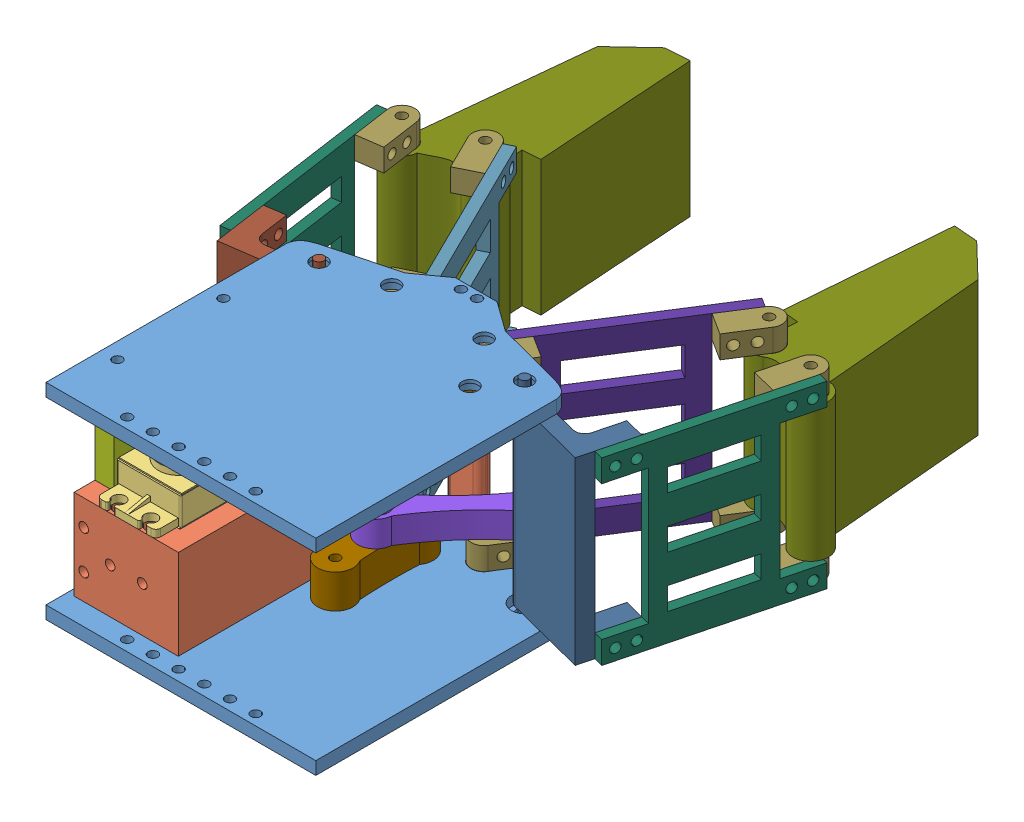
SolidWorks assembly claw assembly.SLDASM, configuration Default (file format 15000). Lengths in mm.
Overall size (189.96 66 208.3).
34 component instances, 20 part files, 67 mates.
Components (placement in the parent):
- new wall partition(inner)-1: new wall partition(inner).SLDPRT [Default] at (40 4 -80) x (-1 0 0) z (0 0 1) size (84 4 91.94)
- servo mount-1: servo mount.SLDPRT [Default] at (16.23 4 -30.49) size (32.46 28 54)
- Servo MG996R-1: Servo MG996R.SLDPRT [По умолчанию] at (16.23 11.5 -33.74) x (0 0 1) z (0 1 0) size (54.5 20.5 40.7)
- flange for servo-1: flange for servo.SLDPRT [Default] at (16.23 50.7 -43.94) x (-0.124022 0 -0.992279) z (-0.992279 0 0.124022) size (20 6 20)
- mechanism flange connector-1: mechanism flange connector.SLDPRT [Default] at (16.23 50.7 -43.94) x (0.992279 0 -0.124022) z (0.124022 0 0.992279) size (41 3 20)
- joint-1: joint.SLDPRT [Default] at (41.0244 45.7 -59.5406) x (0.999999 0 -0.001005) z (0.001005 0 0.999999) size (11 5 36)
- extended wall-1: extended wall.SLDPRT [Default] at (2.99 4 -33.74) size (5.98 56 41)
- long joint-1: long joint.SLDPRT [Default] at (29.4044 37.7 -71.6978) x (0.722901 0 -0.690951) z (0.690951 0 0.722901) size (11 8 51)
- long joint-2: long joint.SLDPRT [Default] at (52.4139 14.7 -71.9141) x (0.735758 0 0.677244) z (-0.677244 0 0.735758) size (11 8 51)
- joint (with hole)-1: joint (with hole).SLDPRT [Default] at (41.0244 4.2 -59.5406) x (0.999999 0 -0.001005) z (0.001005 0 0.999999) size (11 10.5 36)
- L connector( right side)-1: L connector( right side).SLDPRT [Default] at (93.5655 32 -69.443) x (-0.968367 0 -0.249528) z (-0.249528 0 0.968367) size (35.91 66 17.56)
- L connector-1: L connector.SLDPRT [Default] at (-14.0432 32 -71.8295) x (0.989814 0 -0.142368) z (0.142368 0 0.989814) size (35.91 66 17.56)
- nail connector with hole-1: nail connector with hole.SLDPRT [Default] at (25.6 53 -80) x (-0.896581 0 0.442879) z (-0.442879 0 -0.896581) size (8 7 15.99)
- nail connector with hole-2: nail connector with hole.SLDPRT [Default] at (25.6 4 -80) x (-0.896581 0 0.442879) z (-0.442879 0 -0.896581) size (8 7 15.99)
- square connector-1: square connector.SLDPRT [Default] at (41.0244 22.7 -59.5406) size (7 15 7)
- plank connector(inner left)(40.30mm)-1: plank connector(inner left)(40.30mm).SLDPRT [Default] at (14.9523 32 -110.5873) x (0.896581 0 -0.442879) z (0 -1 0) size (3.3 65.04 59.85)
- plank connector-1: plank connector.SLDPRT [Default] at (-25.317 32 -101.8149) x (0.989814 0 -0.142368) z (0 -1 0) size (3 64.46 59.85)
- new claw-1: new claw.SLDPRT [Default] at (10.7806 32 -47.0046) x (0.997719 0 -0.067502) z (0.067502 0 0.997719) size (104.57 42 197.84)
- nail connector with hole-3: nail connector with hole.SLDPRT [Default] at (-22.4849 53 -131.293) x (0.989814 0 -0.142368) z (0.142368 0 0.989814) size (8 7 15.99)
- nail connector with hole-4: nail connector with hole.SLDPRT [Default] at (-22.4849 4 -131.293) x (0.989814 0 -0.142368) z (0.142368 0 0.989814) size (8 7 15.99)
- nail connector with hole-5: nail connector with hole.SLDPRT [Default] at (-2.868 4 -137.6316) x (0.896581 0 -0.442879) z (0.442879 0 0.896581) size (8 7 15.99)
- nail connector with hole-6: nail connector with hole.SLDPRT [Default] at (-2.868 53 -137.6316) x (0.896581 0 -0.442879) z (0.442879 0 0.896581) size (8 7 15.99)
- nail connector with hole-7: nail connector with hole.SLDPRT [Default] at (54.4 3.9949 -80) x (-0.8436 0 -0.536973) z (0.536973 0 -0.8436) size (8 7 15.99)
- nail connector with hole-8: nail connector with hole.SLDPRT [Default] at (54.4 52.9949 -80) x (-0.8436 0 -0.536973) z (0.536973 0 -0.8436) size (8 7 15.99)
- plank connector-2: plank connector.SLDPRT [Default] at (105.139 32 -98.7677) x (0.968367 0 0.249528) z (0 -1 0) size (3 64.46 59.85)
- plank connector(inner right)-2: plank connector(inner right).SLDPRT [Default] at (65.4972 31.9949 -111.0287) x (0.8436 0 0.536973) z (0 -1 0) size (3.3 65.04 59.85)
- nail connector with hole-9: nail connector with hole.SLDPRT [Default] at (108.4456 53 -127.6303) x (0.968367 0 0.249528) z (-0.249528 0 0.968367) size (8 7 15.99)
- nail connector with hole-10: nail connector with hole.SLDPRT [Default] at (108.4456 4 -127.6303) x (0.968367 0 0.249528) z (-0.249528 0 0.968367) size (8 7 15.99)
- nail connector with hole-11: nail connector with hole.SLDPRT [Default] at (88.9108 3.9949 -134.2176) x (0.8436 0 0.536973) z (-0.536973 0 0.8436) size (8 7 15.99)
- nail connector with hole-12: nail connector with hole.SLDPRT [Default] at (88.9108 52.9949 -134.2176) x (0.8436 0 0.536973) z (-0.536973 0 0.8436) size (8 7 15.99)
- straight joint-1: straight joint.SLDPRT [Default] at (51.5501 50.7 -68.9476) x (0.959525 0 0.281622) z (-0.281622 0 0.959525) size (30 9 5)
- new wall partition(outer)-1: new wall partition(outer).SLDPRT [Default] at (40 60 -80) size (84 4 91.94)
- new claw-2: new claw.SLDPRT [Default] at (74.1121 31.9949 -43.7713) x (-0.996781 0 -0.080171) z (-0.080171 0 0.996781) size (104.57 42 197.84)
- top spacer-1: top spacer.SLDPRT [Default] at (40 4 -89.6903) size (11 56 4.5)
Mates (geometry in assembly coordinates):
- Coincident1: coincident aligned: circle of new wall partition(inner)-1; circle of servo mount-1
- Coincident2: coincident aligned: circle of new wall partition(inner)-1; circle of servo mount-1
- Coincident5: coincident aligned: plane of new wall partition(inner)-1 through (40 0 0) normal (0 0 1)
- Coincident6: coincident anti-aligned: plane of new wall partition(inner)-1 through (40 0 -80) normal (0 -1 0)
- Coincident7: coincident anti-aligned: plane of servo mount-1 through (0 32 -30.49) normal (-1 0 0)
- Coincident9: coincident anti-aligned: plane of servo mount-1 through (16.23 32 -13.24) normal (0 0 -1); plane of Servo MG996R-1 through (26.48 32 -13.24) normal (0 0 1)
- Coincident11: coincident anti-aligned: plane of servo mount-1 through (16.23 32 -30.49) normal (0 1 0); plane of Servo MG996R-1 through (16.23 32 -33.74) normal (0 -1 0)
- Coincident12: coincident anti-aligned: circle of Servo MG996R-1; circle of flange for servo-1
- Coincident13: coincident anti-aligned: circle of flange for servo-1; circle of mechanism flange connector-1
- Coincident14: coincident anti-aligned: circle of flange for servo-1; circle of mechanism flange connector-1
- Concentric1: concentric aligned: circle of mechanism flange connector-1; circle of joint-1
- Coincident15: coincident anti-aligned: plane of mechanism flange connector-1 through (16.23 50.7 -43.94) normal (0 -1 0); plane of joint-1 through (41.0244 50.7 -59.5406) normal (0 1 0)
- Coincident16: coincident anti-aligned: plane of servo mount-1 through (26.48 32 -30.49) normal (-1 0 0); plane of Servo MG996R-1 through (26.48 32 -54.24) normal (1 0 0)
- Coincident17: coincident aligned: circle of new wall partition(inner)-1; circle of extended wall-1
- Coincident18: coincident aligned: circle of new wall partition(inner)-1; circle of extended wall-1
- Coincident19: coincident anti-aligned: circle of servo mount-1; circle of extended wall-1
- Concentric4: concentric aligned: circle of long joint-2; circle of joint (with hole)-1
- Coincident24: coincident anti-aligned: plane of long joint-2 through (52.4139 14.7 -71.9141) normal (0 -1 0); plane of joint (with hole)-1 through (41.0244 14.7 -59.5406) normal (0 1 0)
- Concentric5: concentric aligned: circle of joint-1; circle of joint (with hole)-1
- Concentric6: concentric aligned: circle of joint-1; circle of joint (with hole)-1
- Concentric8: concentric aligned: circle of new wall partition(inner)-1; circle of L connector( right side)-1
- Coincident27: coincident anti-aligned: plane of new wall partition(inner)-1 through (40 4 -80) normal (0 1 0); plane of L connector( right side)-1 through (93.5655 4 -69.443) normal (0 -1 0)
- Concentric11: concentric anti-aligned: circle of new wall partition(inner)-1; circle of L connector-1
- Coincident28: coincident anti-aligned: plane of new wall partition(inner)-1 through (40 4 -80) normal (0 1 0); plane of L connector-1 through (-14.0432 4 -71.8295) normal (0 -1 0)
- Concentric13: concentric aligned: circle of long joint-1; circle of L connector-1
- Concentric14: concentric anti-aligned: circle of joint-1; circle of long joint-1
- Coincident29: coincident anti-aligned: plane of joint-1 through (41.0244 45.7 -59.5406) normal (0 -1 0); plane of long joint-1 through (29.4044 45.7 -71.6978) normal (0 1 0)
- Coincident30: coincident aligned: circle of new wall partition(inner)-1; plane of nail connector with hole-2 through (25.6 4 -80) normal (0 -1 0)
- Concentric16: concentric aligned: circle of long joint-1; circle of square connector-1
- Concentric17: concentric aligned: circle of long joint-2; circle of square connector-1
- Coincident32: coincident anti-aligned: plane of long joint-2 through (52.4139 22.7 -71.9141) normal (0 1 0); plane of square connector-1 through (41.0244 22.7 -59.5406) normal (0 -1 0)
- Coincident33: coincident anti-aligned: plane of long joint-1 through (29.4044 37.7 -71.6978) normal (0 -1 0); plane of square connector-1 through (41.0244 37.7 -59.5406) normal (0 1 0)
- Concentric18: concentric aligned: circle of nail connector with hole-2; circle of new wall partition(inner)-1
- Coincident36: coincident aligned: circle of nail connector with hole-2; circle of plank connector(inner left)(40.30mm)-1
- Coincident37: coincident anti-aligned: circle of nail connector with hole-1; circle of plank connector(inner left)(40.30mm)-1
- Coincident38: coincident anti-aligned: circle of L connector-1; circle of plank connector-1
- Coincident39: coincident aligned: circle of L connector-1; circle of plank connector-1
- Concentric19: concentric anti-aligned: circle of long joint-2; circle of L connector( right side)-1
- Coincident40: coincident anti-aligned: circle of plank connector-1; circle of nail connector with hole-3
- Coincident42: coincident aligned: circle of plank connector-1; circle of nail connector with hole-4
- Coincident43: coincident anti-aligned: circle of plank connector(inner left)(40.30mm)-1; circle of nail connector with hole-5
- Coincident45: coincident aligned: circle of plank connector(inner left)(40.30mm)-1; circle of nail connector with hole-6
- Concentric20: concentric aligned: circle of claw with protrusions-1; circle of nail connector with hole-6
- Concentric21: concentric aligned: circle of claw with protrusions-1; circle of nail connector with hole-3
- Coincident46: coincident anti-aligned: plane of claw with protrusions-1 through (10.7806 53 -47.0046) normal (0 1 0); plane of nail connector with hole-3 through (-22.4849 53 -131.293) normal (0 -1 0)
- Concentric22: concentric anti-aligned: circle of new wall partition(inner)-1; circle of nail connector with hole-7
- Coincident47: coincident aligned: circle of L connector( right side)-1; circle of plank connector-2
- Coincident48: coincident anti-aligned: circle of L connector( right side)-1; circle of plank connector-2
- Coincident50: coincident aligned: circle of nail connector with hole-8; circle of plank connector(inner right)-2
- Coincident54: coincident anti-aligned: circle of nail connector with hole-7; circle of plank connector(inner right)-2
- Coincident55: coincident aligned: circle of plank connector-2; circle of nail connector with hole-9
- Coincident56: coincident anti-aligned: circle of plank connector-2; circle of nail connector with hole-10
- Coincident57: coincident aligned: circle of plank connector(inner right)-2; circle of nail connector with hole-11
- Coincident58: coincident anti-aligned: circle of plank connector(inner right)-2; circle of nail connector with hole-12
- Concentric26: concentric aligned: circle of joint-1; circle of straight joint-1
- Coincident60: coincident anti-aligned: plane of joint-1 through (41.0244 50.7 -59.5406) normal (0 1 0); plane of straight joint-1 through (51.5501 50.7 -68.9476) normal (0 -1 0)
- Concentric31: concentric aligned: circle of L connector-1; circle of new wall partition(outer)-1
- Concentric32: concentric aligned: circle of nail connector with hole-1; circle of new wall partition(outer)-1
- Concentric33: concentric anti-aligned: circle of nail connector with hole-8; circle of new wall partition(outer)-1
- Concentric34: concentric anti-aligned: circle of L connector( right side)-1; circle of new wall partition(outer)-1
- Concentric35: concentric aligned: circle of straight joint-1; circle of new wall partition(outer)-1
- Coincident63: coincident anti-aligned: plane of L connector-1 through (-14.0432 60 -71.8295) normal (0 1 0); plane of new wall partition(outer)-1 through (40 60 -80) normal (0 -1 0)
- Concentric36: concentric aligned: circle of nail connector with hole-9; circle of new claw-2
- Concentric37: concentric aligned: circle of nail connector with hole-12; circle of new claw-2
- Coincident64: coincident anti-aligned: plane of nail connector with hole-12 through (88.9108 52.9949 -134.2176) normal (0 -1 0); plane of new claw-2 through (74.1121 52.9949 -43.7713) normal (0 1 0)
- Concentric38: concentric aligned: circle of new wall partition(outer)-1; circle of top spacer-1
- Concentric39: concentric aligned: circle of new wall partition(inner)-1; circle of top spacer-1
